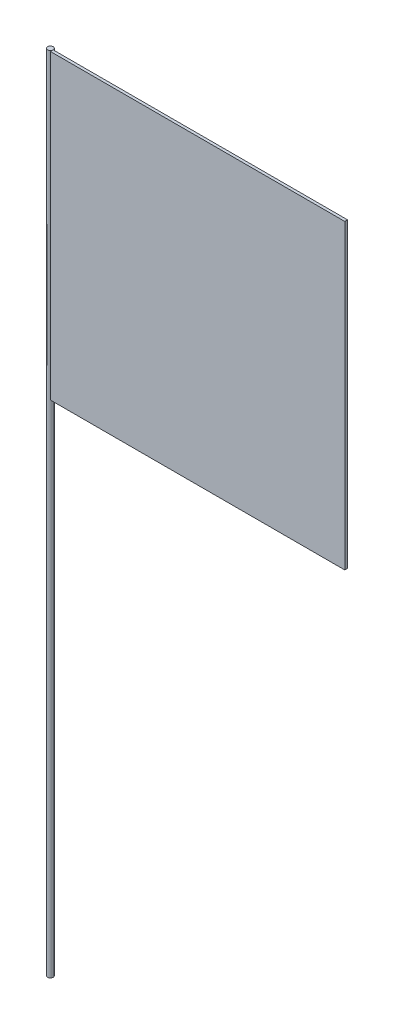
ISO-10303-21;
HEADER;
FILE_DESCRIPTION(('STEP AP214'),'2;1');
FILE_NAME('part.step','',(''),(''),'','','');
FILE_SCHEMA(('AUTOMOTIVE_DESIGN { 1 0 10303 214 1 1 1 1 }'));
ENDSEC;
DATA;
#1=APPLICATION_CONTEXT('core data for automotive mechanical design processes');
#2=APPLICATION_PROTOCOL_DEFINITION('international standard','automotive_design',2000,#1);
#3=PRODUCT_CONTEXT('',#1,'mechanical');
#4=PRODUCT('Part','Part','',(#3));
#5=PRODUCT_RELATED_PRODUCT_CATEGORY('part','',(#4));
#6=PRODUCT_DEFINITION_FORMATION('','',#4);
#7=PRODUCT_DEFINITION_CONTEXT('part definition',#1,'design');
#8=PRODUCT_DEFINITION('design','',#6,#7);
#9=PRODUCT_DEFINITION_SHAPE('','',#8);
#10=(LENGTH_UNIT() NAMED_UNIT(*) SI_UNIT(.MILLI.,.METRE.));
#11=(NAMED_UNIT(*) PLANE_ANGLE_UNIT() SI_UNIT($,.RADIAN.));
#12=(NAMED_UNIT(*) SI_UNIT($,.STERADIAN.) SOLID_ANGLE_UNIT());
#13=UNCERTAINTY_MEASURE_WITH_UNIT(LENGTH_MEASURE(1.E-05),#10,'distance_accuracy_value','');
#14=(GEOMETRIC_REPRESENTATION_CONTEXT(3) GLOBAL_UNCERTAINTY_ASSIGNED_CONTEXT((#13)) GLOBAL_UNIT_ASSIGNED_CONTEXT((#10,
#11,#12)) REPRESENTATION_CONTEXT('',''));
#15=CARTESIAN_POINT('',(0.,0.,0.));
#16=DIRECTION('',(0.,0.,1.));
#17=DIRECTION('',(1.,0.,0.));
#18=AXIS2_PLACEMENT_3D('',#15,#16,#17);
#19=CARTESIAN_POINT('',(0.5,145.,0.5));
#20=DIRECTION('',(1.,0.,0.));
#21=DIRECTION('',(0.,0.,-1.));
#22=AXIS2_PLACEMENT_3D('',#19,#20,#21);
#23=PLANE('',#22);
#24=DIRECTION('',(0.,-1.,0.));
#25=VECTOR('',#24,1.);
#26=CARTESIAN_POINT('',(0.5,145.,0.));
#27=LINE('',#26,#25);
#28=CARTESIAN_POINT('',(0.5,145.,0.));
#29=VERTEX_POINT('',#28);
#30=CARTESIAN_POINT('',(0.5,90.5061801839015,0.));
#31=VERTEX_POINT('',#30);
#32=EDGE_CURVE('E116',#29,#31,#27,.T.);
#33=ORIENTED_EDGE('',*,*,#32,.T.);
#34=DIRECTION('',(0.,0.,-1.));
#35=VECTOR('',#34,1.);
#36=CARTESIAN_POINT('',(0.5,90.5061801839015,0.5));
#37=LINE('',#36,#35);
#38=CARTESIAN_POINT('',(0.5,90.5061801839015,0.5));
#39=VERTEX_POINT('',#38);
#40=EDGE_CURVE('E12',#39,#31,#37,.T.);
#41=ORIENTED_EDGE('',*,*,#40,.F.);
#42=DIRECTION('',(0.,-1.,0.));
#43=VECTOR('',#42,1.);
#44=CARTESIAN_POINT('',(0.5,145.,0.5));
#45=LINE('',#44,#43);
#46=CARTESIAN_POINT('',(0.5,145.,0.5));
#47=VERTEX_POINT('',#46);
#48=EDGE_CURVE('E104',#47,#39,#45,.T.);
#49=ORIENTED_EDGE('',*,*,#48,.F.);
#50=DIRECTION('',(0.,0.,-1.));
#51=VECTOR('',#50,1.);
#52=CARTESIAN_POINT('',(0.5,145.,0.5));
#53=LINE('',#52,#51);
#54=EDGE_CURVE('E112',#47,#29,#53,.T.);
#55=ORIENTED_EDGE('',*,*,#54,.T.);
#56=EDGE_LOOP('',(#33,#41,#49,#55));
#57=FACE_BOUND('',#56,.T.);
#58=ADVANCED_FACE('F53',(#57),#23,.F.);
#59=CARTESIAN_POINT('',(0.5,90.5061801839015,0.5));
#60=DIRECTION('',(0.,1.,0.));
#61=DIRECTION('',(0.,0.,1.));
#62=AXIS2_PLACEMENT_3D('',#59,#60,#61);
#63=PLANE('',#62);
#64=DIRECTION('',(1.,0.,0.));
#65=VECTOR('',#64,1.);
#66=CARTESIAN_POINT('',(0.5,90.5061801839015,0.));
#67=LINE('',#66,#65);
#68=CARTESIAN_POINT('',(53.6392489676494,90.5061801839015,0.));
#69=VERTEX_POINT('',#68);
#70=EDGE_CURVE('E108',#31,#69,#67,.T.);
#71=ORIENTED_EDGE('',*,*,#70,.T.);
#72=DIRECTION('',(0.,0.,-1.));
#73=VECTOR('',#72,1.);
#74=CARTESIAN_POINT('',(53.6392489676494,90.5061801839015,0.5));
#75=LINE('',#74,#73);
#76=CARTESIAN_POINT('',(53.6392489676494,90.5061801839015,0.5));
#77=VERTEX_POINT('',#76);
#78=EDGE_CURVE('E61',#77,#69,#75,.T.);
#79=ORIENTED_EDGE('',*,*,#78,.F.);
#80=DIRECTION('',(1.,0.,0.));
#81=VECTOR('',#80,1.);
#82=CARTESIAN_POINT('',(0.5,90.5061801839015,0.5));
#83=LINE('',#82,#81);
#84=EDGE_CURVE('E99',#39,#77,#83,.T.);
#85=ORIENTED_EDGE('',*,*,#84,.F.);
#86=ORIENTED_EDGE('',*,*,#40,.T.);
#87=EDGE_LOOP('',(#71,#79,#85,#86));
#88=FACE_BOUND('',#87,.T.);
#89=ADVANCED_FACE('F107',(#88),#63,.F.);
#90=CARTESIAN_POINT('',(53.6392489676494,145.,0.5));
#91=DIRECTION('',(-1.,0.,0.));
#92=DIRECTION('',(0.,0.,1.));
#93=AXIS2_PLACEMENT_3D('',#90,#91,#92);
#94=PLANE('',#93);
#95=DIRECTION('',(0.,1.,0.));
#96=VECTOR('',#95,1.);
#97=CARTESIAN_POINT('',(53.6392489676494,145.,0.));
#98=LINE('',#97,#96);
#99=CARTESIAN_POINT('',(53.6392489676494,145.,0.));
#100=VERTEX_POINT('',#99);
#101=EDGE_CURVE('E86',#69,#100,#98,.T.);
#102=ORIENTED_EDGE('',*,*,#101,.T.);
#103=DIRECTION('',(0.,0.,-1.));
#104=VECTOR('',#103,1.);
#105=CARTESIAN_POINT('',(53.6392489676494,145.,0.5));
#106=LINE('',#105,#104);
#107=CARTESIAN_POINT('',(53.6392489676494,145.,0.5));
#108=VERTEX_POINT('',#107);
#109=EDGE_CURVE('E109',#108,#100,#106,.T.);
#110=ORIENTED_EDGE('',*,*,#109,.F.);
#111=DIRECTION('',(0.,1.,0.));
#112=VECTOR('',#111,1.);
#113=CARTESIAN_POINT('',(53.6392489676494,145.,0.5));
#114=LINE('',#113,#112);
#115=EDGE_CURVE('E102',#77,#108,#114,.T.);
#116=ORIENTED_EDGE('',*,*,#115,.F.);
#117=ORIENTED_EDGE('',*,*,#78,.T.);
#118=EDGE_LOOP('',(#102,#110,#116,#117));
#119=FACE_BOUND('',#118,.T.);
#120=ADVANCED_FACE('F110',(#119),#94,.F.);
#121=CARTESIAN_POINT('',(0.5,145.,0.5));
#122=DIRECTION('',(0.,-1.,0.));
#123=DIRECTION('',(0.,0.,-1.));
#124=AXIS2_PLACEMENT_3D('',#121,#122,#123);
#125=PLANE('',#124);
#126=DIRECTION('',(-1.,0.,0.));
#127=VECTOR('',#126,1.);
#128=CARTESIAN_POINT('',(0.5,145.,0.));
#129=LINE('',#128,#127);
#130=EDGE_CURVE('E92',#100,#29,#129,.T.);
#131=ORIENTED_EDGE('',*,*,#130,.T.);
#132=ORIENTED_EDGE('',*,*,#54,.F.);
#133=DIRECTION('',(-1.,0.,0.));
#134=VECTOR('',#133,1.);
#135=CARTESIAN_POINT('',(0.5,145.,0.5));
#136=LINE('',#135,#134);
#137=EDGE_CURVE('E69',#108,#47,#136,.T.);
#138=ORIENTED_EDGE('',*,*,#137,.F.);
#139=ORIENTED_EDGE('',*,*,#109,.T.);
#140=EDGE_LOOP('',(#131,#132,#138,#139));
#141=FACE_BOUND('',#140,.T.);
#142=ADVANCED_FACE('F123',(#141),#125,.F.);
#143=CARTESIAN_POINT('',(0.,0.,0.5));
#144=DIRECTION('',(0.,0.,1.));
#145=DIRECTION('',(1.,0.,0.));
#146=AXIS2_PLACEMENT_3D('',#143,#144,#145);
#147=PLANE('',#146);
#148=ORIENTED_EDGE('',*,*,#48,.T.);
#149=ORIENTED_EDGE('',*,*,#84,.T.);
#150=ORIENTED_EDGE('',*,*,#115,.T.);
#151=ORIENTED_EDGE('',*,*,#137,.T.);
#152=EDGE_LOOP('',(#148,#149,#150,#151));
#153=FACE_BOUND('',#152,.T.);
#154=ADVANCED_FACE('F100',(#153),#147,.T.);
#155=CARTESIAN_POINT('',(0.,0.,0.));
#156=DIRECTION('',(0.,0.,1.));
#157=DIRECTION('',(1.,0.,0.));
#158=AXIS2_PLACEMENT_3D('',#155,#156,#157);
#159=PLANE('',#158);
#160=ORIENTED_EDGE('',*,*,#32,.F.);
#161=ORIENTED_EDGE('',*,*,#130,.F.);
#162=ORIENTED_EDGE('',*,*,#101,.F.);
#163=ORIENTED_EDGE('',*,*,#70,.F.);
#164=EDGE_LOOP('',(#160,#161,#162,#163));
#165=FACE_BOUND('',#164,.T.);
#166=ADVANCED_FACE('F126',(#165),#159,.F.);
#167=CLOSED_SHELL('',(#58,#89,#120,#142,#154,#166));
#168=MANIFOLD_SOLID_BREP('B2',#167);
#169=CARTESIAN_POINT('',(0.,145.,0.));
#170=DIRECTION('',(0.,-1.,0.));
#171=DIRECTION('',(0.,0.,-1.));
#172=AXIS2_PLACEMENT_3D('',#169,#170,#171);
#173=CYLINDRICAL_SURFACE('',#172,0.5);
#174=CARTESIAN_POINT('',(0.,145.,0.));
#175=DIRECTION('',(0.,1.,0.));
#176=DIRECTION('',(0.,0.,1.));
#177=AXIS2_PLACEMENT_3D('',#174,#175,#176);
#178=CIRCLE('',#177,0.5);
#179=CARTESIAN_POINT('',(0.,145.,0.5));
#180=VERTEX_POINT('',#179);
#181=EDGE_CURVE('E52',#180,#180,#178,.T.);
#182=ORIENTED_EDGE('',*,*,#181,.F.);
#183=EDGE_LOOP('',(#182));
#184=FACE_BOUND('',#183,.T.);
#185=CARTESIAN_POINT('',(0.,0.,0.));
#186=DIRECTION('',(0.,1.,0.));
#187=DIRECTION('',(0.,0.,1.));
#188=AXIS2_PLACEMENT_3D('',#185,#186,#187);
#189=CIRCLE('',#188,0.5);
#190=CARTESIAN_POINT('',(0.,0.,0.5));
#191=VERTEX_POINT('',#190);
#192=EDGE_CURVE('E192',#191,#191,#189,.T.);
#193=ORIENTED_EDGE('',*,*,#192,.T.);
#194=EDGE_LOOP('',(#193));
#195=FACE_BOUND('',#194,.T.);
#196=ADVANCED_FACE('F189',(#184,#195),#173,.T.);
#197=CARTESIAN_POINT('',(0.,145.,0.));
#198=DIRECTION('',(0.,1.,0.));
#199=DIRECTION('',(0.,0.,1.));
#200=AXIS2_PLACEMENT_3D('',#197,#198,#199);
#201=PLANE('',#200);
#202=ORIENTED_EDGE('',*,*,#181,.T.);
#203=EDGE_LOOP('',(#202));
#204=FACE_BOUND('',#203,.T.);
#205=ADVANCED_FACE('F204',(#204),#201,.T.);
#206=CARTESIAN_POINT('',(0.,0.,0.));
#207=DIRECTION('',(0.,1.,0.));
#208=DIRECTION('',(0.,0.,1.));
#209=AXIS2_PLACEMENT_3D('',#206,#207,#208);
#210=PLANE('',#209);
#211=ORIENTED_EDGE('',*,*,#192,.F.);
#212=EDGE_LOOP('',(#211));
#213=FACE_BOUND('',#212,.T.);
#214=ADVANCED_FACE('F202',(#213),#210,.F.);
#215=CLOSED_SHELL('',(#196,#205,#214));
#216=MANIFOLD_SOLID_BREP('B6',#215);
#217=ADVANCED_BREP_SHAPE_REPRESENTATION('',(#18,#168,#216),#14);
#218=SHAPE_DEFINITION_REPRESENTATION(#9,#217);
ENDSEC;
END-ISO-10303-21;
